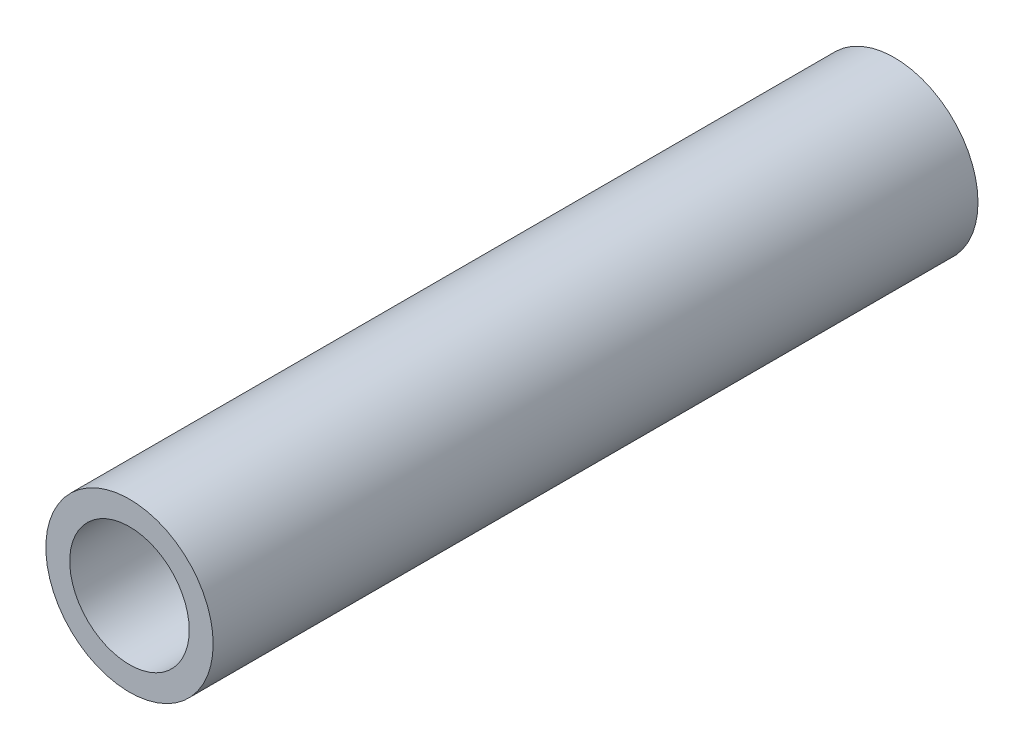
from build123d import *

# Parameters (mm, degrees)
SKETCH1_R      = 11.1125
EXTRUDE1_DEPTH = 101.6
SKETCH2_R      = 7.9375
EXTRUDE2_DEPTH = 103.808245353


with BuildPart() as part:
    # Sketch1 → Extrude1 (new body)
    with BuildSketch(Plane.XY):
        Circle(SKETCH1_R)
    extrude(amount=EXTRUDE1_DEPTH)

    # Sketch2 → Extrude2 (cut, through all)
    with BuildSketch(Plane.XY.offset(101.6)):
        Circle(SKETCH2_R)
    extrude(amount=-EXTRUDE2_DEPTH, mode=Mode.SUBTRACT)


solid = part.part
